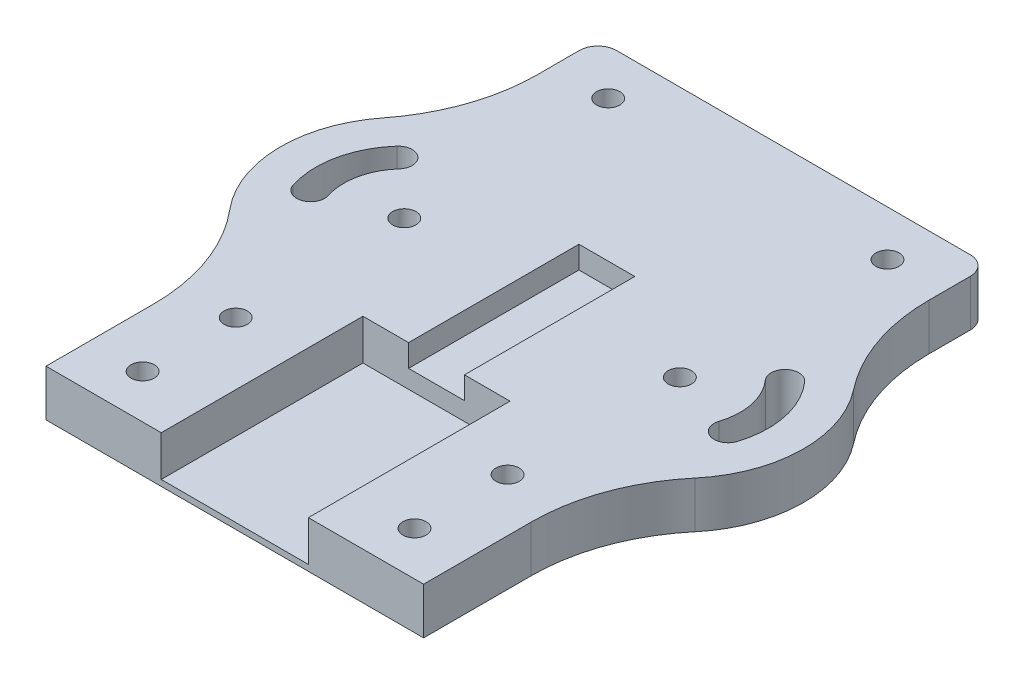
from build123d import *

# Parameters (mm, degrees)
EXTRUDE1_DEPTH     = 6.35
SKETCH2_R          = 1.5875
CUT_EXTRUDE1_DEPTH = 53.585504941
CUT_EXTRUDE2_DEPTH = 6.35
SKETCH4_R          = 1.5875
CUT_EXTRUDE3_DEPTH = 53.585504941
CUT_EXTRUDE4_DEPTH = 5.5245
SKETCH5_3_W        = 7.62
SKETCH5_3_H        = 23.236908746
CUT_EXTRUDE5_DEPTH = 3.048


with BuildPart() as part:
    # Sketch1 → Extrude1 (new body)
    with BuildSketch(Plane(origin=(0, 0, 0), x_dir=(1, 0, 0), z_dir=(0, 1, 0))):
        with BuildLine():
            Line((25.752866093, -38.1), (25.752866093, -23.415994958))
            ThreePointArc((25.752866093, -23.415994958), (27.290608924, -14.712393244), (31.717644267, -7.062642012))
            ThreePointArc((31.717644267, -7.062642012), (35.680871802, 3.519587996), (32.083899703, 14.23184995))
            ThreePointArc((32.083899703, 14.23184995), (28.061595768, 21.615218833), (26.67, 29.907174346))
            Line((26.67, 29.907174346), (26.67, 35.56))
            ThreePointArc((26.67, 35.56), (25.926051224, 37.356051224), (24.13, 38.1))
            Line((24.13, 38.1), (-24.13, 38.1))
            ThreePointArc((-24.13, 38.1), (-25.926051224, 37.356051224), (-26.67, 35.56))
            Line((-26.67, 35.56), (-26.67, 29.907174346))
            ThreePointArc((-26.67, 29.907174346), (-28.061595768, 21.615218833), (-32.083899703, 14.23184995))
            ThreePointArc((-32.083899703, 14.23184995), (-35.680871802, 3.519587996), (-31.717644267, -7.062642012))
            ThreePointArc((-31.717644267, -7.062642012), (-27.290608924, -14.712393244), (-25.752866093, -23.415994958))
            Line((-25.752866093, -23.415994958), (-25.752866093, -38.1))
            Line((-25.752866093, -38.1), (25.752866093, -38.1))
        make_face()
    extrude(amount=EXTRUDE1_DEPTH)

    # Sketch2 → Cut-Extrude1 (cut, through all)
    with BuildSketch(Plane(origin=(0, 6.35, 0), x_dir=(1, 0, 0), z_dir=(0, 1, 0))):
        with Locations(Location((19.05, 31.878296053, 0), (0, 0, 270))):
            Circle(SKETCH2_R)
        with Locations(Location((18.796, 3.81, 0), (0, 0, 90))):
            Circle(SKETCH2_R)
        with Locations(Location((-18.796, 3.81, 0), (0, 0, 270))):
            Circle(SKETCH2_R)
        with Locations(Location((-19.05, 31.878296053, 0), (0, 0, 90))):
            Circle(SKETCH2_R)
    extrude(amount=-CUT_EXTRUDE1_DEPTH, mode=Mode.SUBTRACT)

    # Sketch3 → Cut-Extrude2 (cut)
    with BuildSketch(Plane(origin=(0, 6.35, 0), x_dir=(1, 0, 0), z_dir=(0, 1, 0))):
        with BuildLine():
            ThreePointArc((27.80448669, 11.835670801), (25.114882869, 11.990852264), (24.959701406, 9.301248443))
            ThreePointArc((24.959701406, 9.301248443), (26.871091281, 5.524037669), (26.658899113, 1.29607043))
            ThreePointArc((26.658899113, 1.29607043), (27.893276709, -1.098582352), (30.287929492, 0.135795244))
            ThreePointArc((30.287929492, 0.135795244), (30.598056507, 6.315131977), (27.80448669, 11.835670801))
        make_face()
        with BuildLine():
            ThreePointArc((-26.658899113, 1.29607043), (-27.893276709, -1.098582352), (-30.287929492, 0.135795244))
            ThreePointArc((-30.287929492, 0.135795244), (-30.598056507, 6.315131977), (-27.80448669, 11.835670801))
            ThreePointArc((-27.80448669, 11.835670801), (-25.114882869, 11.990852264), (-24.959701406, 9.301248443))
            ThreePointArc((-24.959701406, 9.301248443), (-26.871091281, 5.524037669), (-26.658899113, 1.29607043))
        make_face()
    extrude(amount=-CUT_EXTRUDE2_DEPTH, mode=Mode.SUBTRACT)

    # Sketch4 → Cut-Extrude3 (cut, through all)
    with BuildSketch(Plane(origin=(0, 6.35, 0), x_dir=(1, 0, 0), z_dir=(0, 1, 0))):
        with Locations(Location((-18.54311349, -19.433598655, 0), (0, 0, 270))):
            Circle(SKETCH4_R)
        with Locations(Location((-18.54311349, -32.133598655, 0), (0, 0, 270))):
            Circle(SKETCH4_R)
        with Locations(Location((18.54311349, -32.133598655, 0), (0, 0, 90))):
            Circle(SKETCH4_R)
        with Locations(Location((18.54311349, -19.433598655, 0), (0, 0, 90))):
            Circle(SKETCH4_R)
    extrude(amount=-CUT_EXTRUDE3_DEPTH, mode=Mode.SUBTRACT)

    # Sketch5 → Cut-Extrude4 (cut)
    with BuildSketch(Plane(origin=(0, 6.35, 0), x_dir=(1, 0, 0), z_dir=(0, 1, 0))):
        Polygon((-10.033, -38.1), (10.033, -38.1), (10.033, -10.584666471), (3.81, -10.584666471), (-3.81, -10.584666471), (-10.033, -10.584666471), align=None)
    extrude(amount=-CUT_EXTRUDE4_DEPTH, mode=Mode.SUBTRACT)

    # Sketch5_3 → Cut-Extrude5 (cut)
    with BuildSketch(Plane(origin=(0, 6.35, 0), x_dir=(1, 0, 0), z_dir=(0, 1, 0))):
        with Locations((0, 1.033787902)):
            Rectangle(SKETCH5_3_W, SKETCH5_3_H)
    extrude(amount=-CUT_EXTRUDE5_DEPTH, mode=Mode.SUBTRACT)


solid = part.part
